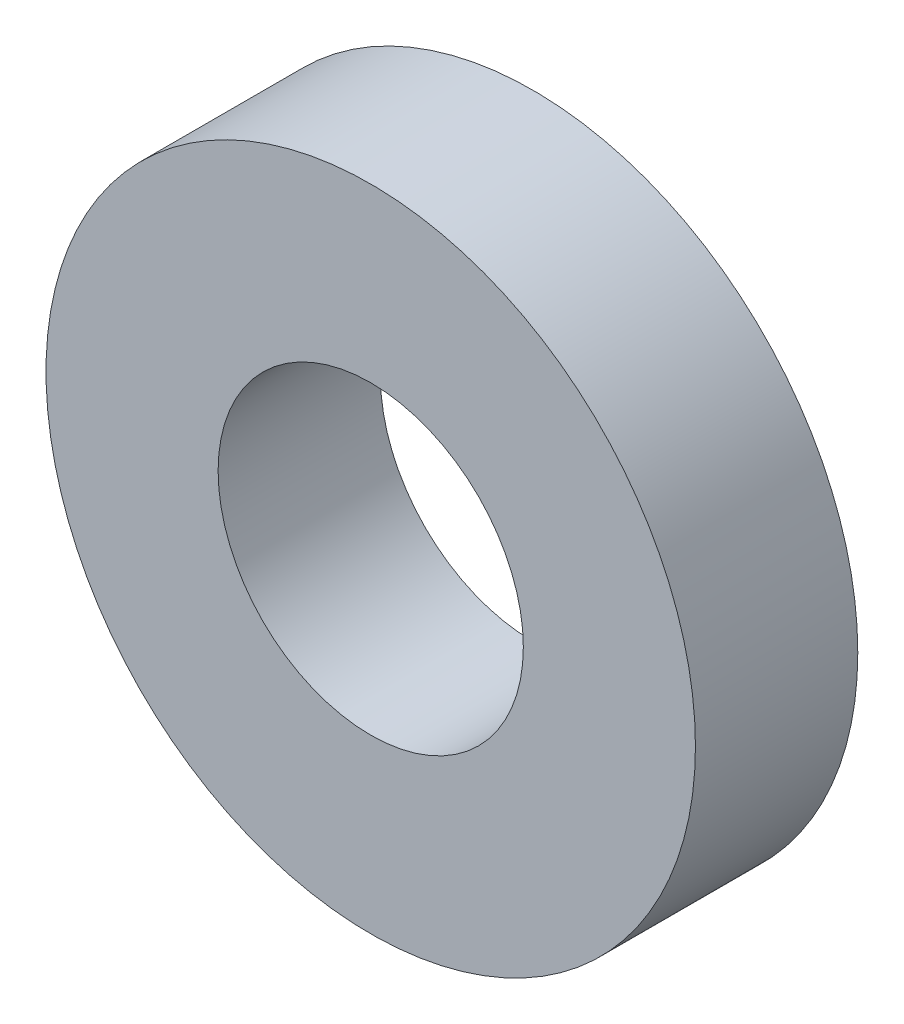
from build123d import *

# Parameters (mm, degrees)
SKETCH1_R      = 5.08
SKETCH1_R_2    = 2.3876
EXTRUDE1_DEPTH = 2.54


with BuildPart() as part:
    # Sketch1 → Extrude1 (new body)
    with BuildSketch(Plane.XY):
        Circle(SKETCH1_R)
        Circle(SKETCH1_R_2, mode=Mode.SUBTRACT)
    extrude(amount=EXTRUDE1_DEPTH)


solid = part.part
